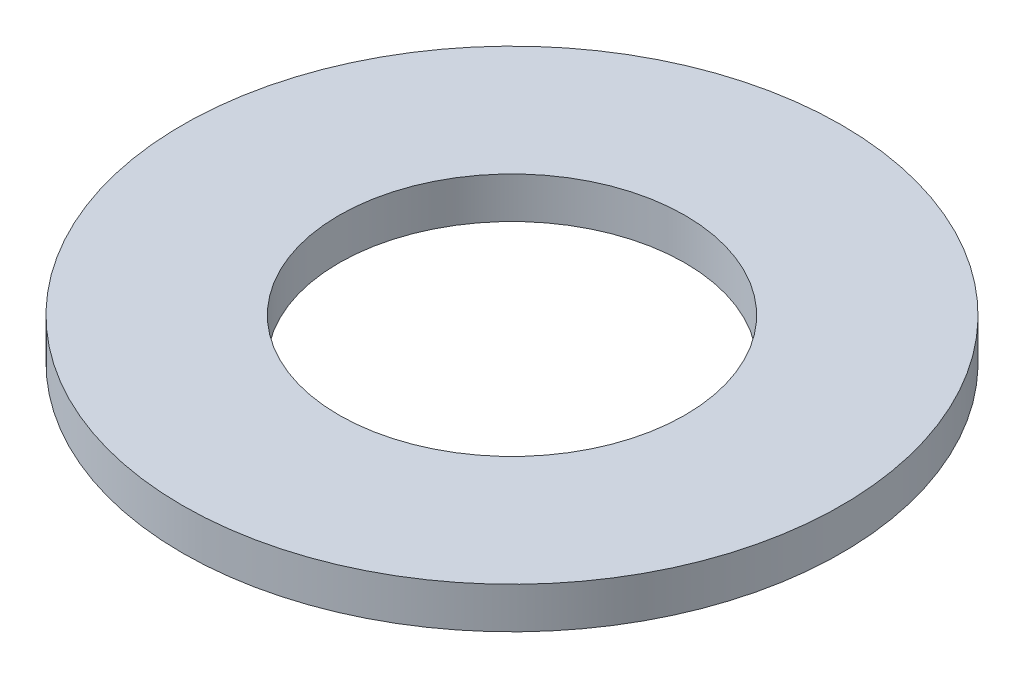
ISO-10303-21;
HEADER;
FILE_DESCRIPTION(('STEP AP214'),'2;1');
FILE_NAME('part.step','',(''),(''),'','','');
FILE_SCHEMA(('AUTOMOTIVE_DESIGN { 1 0 10303 214 1 1 1 1 }'));
ENDSEC;
DATA;
#1=APPLICATION_CONTEXT('core data for automotive mechanical design processes');
#2=APPLICATION_PROTOCOL_DEFINITION('international standard','automotive_design',2000,#1);
#3=PRODUCT_CONTEXT('',#1,'mechanical');
#4=PRODUCT('Part','Part','',(#3));
#5=PRODUCT_RELATED_PRODUCT_CATEGORY('part','',(#4));
#6=PRODUCT_DEFINITION_FORMATION('','',#4);
#7=PRODUCT_DEFINITION_CONTEXT('part definition',#1,'design');
#8=PRODUCT_DEFINITION('design','',#6,#7);
#9=PRODUCT_DEFINITION_SHAPE('','',#8);
#10=(LENGTH_UNIT() NAMED_UNIT(*) SI_UNIT(.MILLI.,.METRE.));
#11=(NAMED_UNIT(*) PLANE_ANGLE_UNIT() SI_UNIT($,.RADIAN.));
#12=(NAMED_UNIT(*) SI_UNIT($,.STERADIAN.) SOLID_ANGLE_UNIT());
#13=UNCERTAINTY_MEASURE_WITH_UNIT(LENGTH_MEASURE(1.E-05),#10,'distance_accuracy_value','');
#14=(GEOMETRIC_REPRESENTATION_CONTEXT(3) GLOBAL_UNCERTAINTY_ASSIGNED_CONTEXT((#13)) GLOBAL_UNIT_ASSIGNED_CONTEXT((#10,
#11,#12)) REPRESENTATION_CONTEXT('',''));
#15=CARTESIAN_POINT('',(0.,0.,0.));
#16=DIRECTION('',(0.,0.,1.));
#17=DIRECTION('',(1.,0.,0.));
#18=AXIS2_PLACEMENT_3D('',#15,#16,#17);
#19=CARTESIAN_POINT('',(0.,5.,0.));
#20=DIRECTION('',(0.,1.,0.));
#21=DIRECTION('',(0.,0.,1.));
#22=AXIS2_PLACEMENT_3D('',#19,#20,#21);
#23=PLANE('',#22);
#24=CARTESIAN_POINT('',(0.,5.,0.));
#25=DIRECTION('',(0.,1.,0.));
#26=DIRECTION('',(0.,0.,1.));
#27=AXIS2_PLACEMENT_3D('',#24,#25,#26);
#28=CIRCLE('',#27,40.);
#29=CARTESIAN_POINT('',(0.,5.,40.));
#30=VERTEX_POINT('',#29);
#31=EDGE_CURVE('E10',#30,#30,#28,.T.);
#32=ORIENTED_EDGE('',*,*,#31,.T.);
#33=EDGE_LOOP('',(#32));
#34=FACE_BOUND('',#33,.T.);
#35=CARTESIAN_POINT('',(0.,5.,0.));
#36=DIRECTION('',(0.,1.,0.));
#37=DIRECTION('',(0.,0.,1.));
#38=AXIS2_PLACEMENT_3D('',#35,#36,#37);
#39=CIRCLE('',#38,21.);
#40=CARTESIAN_POINT('',(0.,5.,21.));
#41=VERTEX_POINT('',#40);
#42=EDGE_CURVE('E39',#41,#41,#39,.T.);
#43=ORIENTED_EDGE('',*,*,#42,.F.);
#44=EDGE_LOOP('',(#43));
#45=FACE_BOUND('',#44,.T.);
#46=ADVANCED_FACE('F28',(#34,#45),#23,.T.);
#47=CARTESIAN_POINT('',(0.,0.,0.));
#48=DIRECTION('',(0.,1.,0.));
#49=DIRECTION('',(0.,0.,1.));
#50=AXIS2_PLACEMENT_3D('',#47,#48,#49);
#51=PLANE('',#50);
#52=CARTESIAN_POINT('',(0.,0.,0.));
#53=DIRECTION('',(0.,1.,0.));
#54=DIRECTION('',(0.,0.,1.));
#55=AXIS2_PLACEMENT_3D('',#52,#53,#54);
#56=CIRCLE('',#55,40.);
#57=CARTESIAN_POINT('',(0.,0.,40.));
#58=VERTEX_POINT('',#57);
#59=EDGE_CURVE('E35',#58,#58,#56,.T.);
#60=ORIENTED_EDGE('',*,*,#59,.F.);
#61=EDGE_LOOP('',(#60));
#62=FACE_BOUND('',#61,.T.);
#63=CARTESIAN_POINT('',(0.,0.,0.));
#64=DIRECTION('',(0.,1.,0.));
#65=DIRECTION('',(0.,0.,1.));
#66=AXIS2_PLACEMENT_3D('',#63,#64,#65);
#67=CIRCLE('',#66,21.);
#68=CARTESIAN_POINT('',(0.,0.,21.));
#69=VERTEX_POINT('',#68);
#70=EDGE_CURVE('E43',#69,#69,#67,.T.);
#71=ORIENTED_EDGE('',*,*,#70,.T.);
#72=EDGE_LOOP('',(#71));
#73=FACE_BOUND('',#72,.T.);
#74=ADVANCED_FACE('F49',(#62,#73),#51,.F.);
#75=CARTESIAN_POINT('',(0.,5.,0.));
#76=DIRECTION('',(0.,-1.,0.));
#77=DIRECTION('',(0.,0.,-1.));
#78=AXIS2_PLACEMENT_3D('',#75,#76,#77);
#79=CYLINDRICAL_SURFACE('',#78,40.);
#80=ORIENTED_EDGE('',*,*,#31,.F.);
#81=EDGE_LOOP('',(#80));
#82=FACE_BOUND('',#81,.T.);
#83=ORIENTED_EDGE('',*,*,#59,.T.);
#84=EDGE_LOOP('',(#83));
#85=FACE_BOUND('',#84,.T.);
#86=ADVANCED_FACE('F30',(#82,#85),#79,.T.);
#87=CARTESIAN_POINT('',(0.,5.,0.));
#88=DIRECTION('',(0.,-1.,0.));
#89=DIRECTION('',(0.,0.,-1.));
#90=AXIS2_PLACEMENT_3D('',#87,#88,#89);
#91=CYLINDRICAL_SURFACE('',#90,21.);
#92=ORIENTED_EDGE('',*,*,#42,.T.);
#93=EDGE_LOOP('',(#92));
#94=FACE_BOUND('',#93,.T.);
#95=ORIENTED_EDGE('',*,*,#70,.F.);
#96=EDGE_LOOP('',(#95));
#97=FACE_BOUND('',#96,.T.);
#98=ADVANCED_FACE('F51',(#94,#97),#91,.F.);
#99=CLOSED_SHELL('',(#46,#74,#86,#98));
#100=MANIFOLD_SOLID_BREP('B2',#99);
#101=ADVANCED_BREP_SHAPE_REPRESENTATION('',(#18,#100),#14);
#102=SHAPE_DEFINITION_REPRESENTATION(#9,#101);
ENDSEC;
END-ISO-10303-21;
